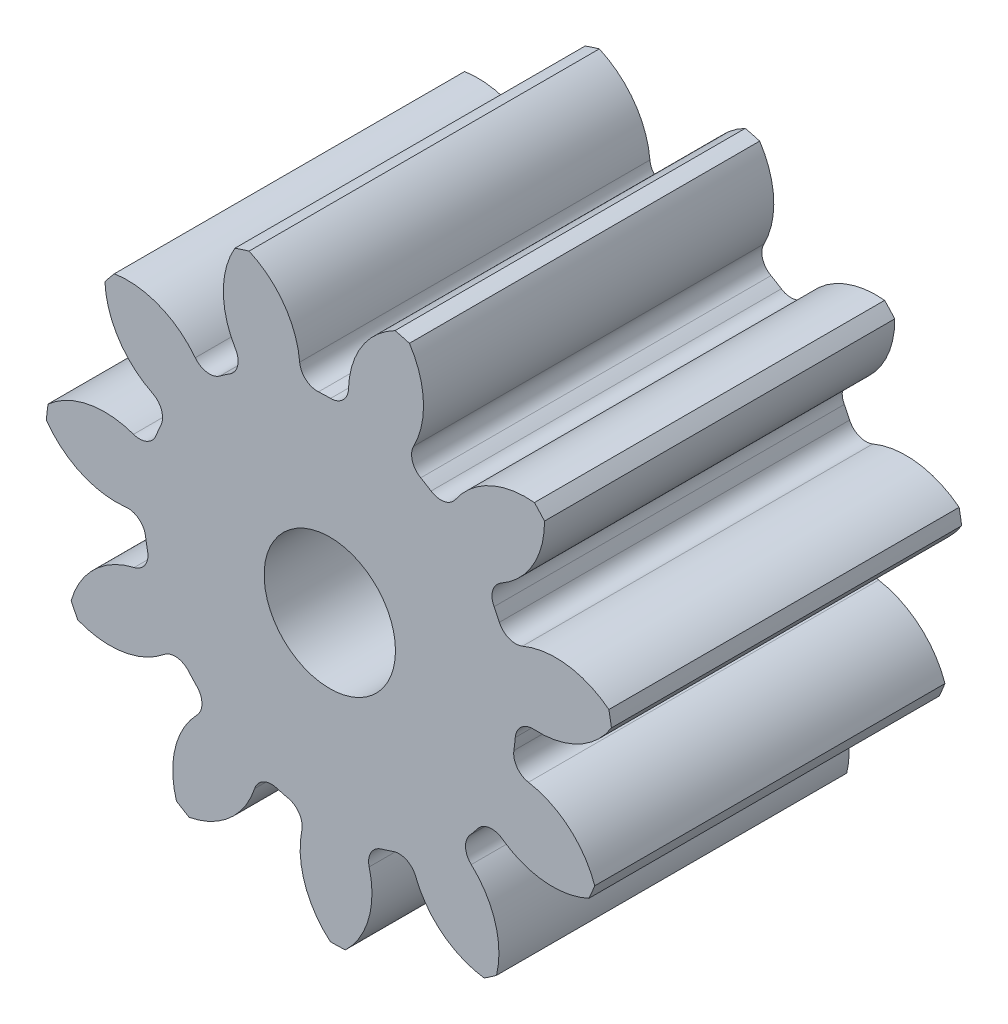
from build123d import *

# Parameters (mm, degrees)
SKETCH3_R         = 82.55
GEARBODY_DEPTH    = 101.6
TOOTHCUT_DEPTH    = 155.762931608
CIRPATTERN1_COUNT = 11
BOREDIA_R         = 19.05
BORE_DEPTH        = 12700


with BuildPart() as part:
    # Sketch3 → gearBody (new body)
    with BuildSketch(Plane.XY):
        Circle(SKETCH3_R)
    extrude(amount=GEARBODY_DEPTH)

    # Sketch2 → toothCut (cut, through all)
    with BuildSketch(Plane.XY):
        with BuildLine():
            ThreePointArc((53.392584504, -7.907752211), (53.621404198, -6.168114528), (53.793558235, -4.421958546))
            ThreePointArc((53.793558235, -4.421958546), (55.551903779, -0.946212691), (59.237198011, 0.315212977))
            ThreePointArc((59.237198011, 0.315212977), (72.804916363, 3.45708721), (82.55, 13.406343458))
            ThreePointArc((82.55, 13.406343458), (83.083649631, -9.557181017), (77.349904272, -31.799761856))
            ThreePointArc((77.349904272, -31.799761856), (70.118398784, -19.897674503), (57.618435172, -13.757213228))
            ThreePointArc((57.618435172, -13.757213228), (54.315811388, -11.691961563), (53.392584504, -7.907752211))
        make_face()
    toothcut = extrude(amount=TOOTHCUT_DEPTH, mode=Mode.SUBTRACT)

    # CirPattern1: toothCut ×11 about axis
    cirpattern1_axis = Axis((0, 0, 0), (0, 0, 1))
    for i in range(1, CIRPATTERN1_COUNT):
        add(toothcut.rotate(cirpattern1_axis, i * 360 / CIRPATTERN1_COUNT), mode=Mode.SUBTRACT)

    # boreDia → bore (cut, symmetric)
    with BuildSketch(Plane.XY):
        Circle(BOREDIA_R)
    extrude(amount=BORE_DEPTH, both=True, mode=Mode.SUBTRACT)


solid = part.part
